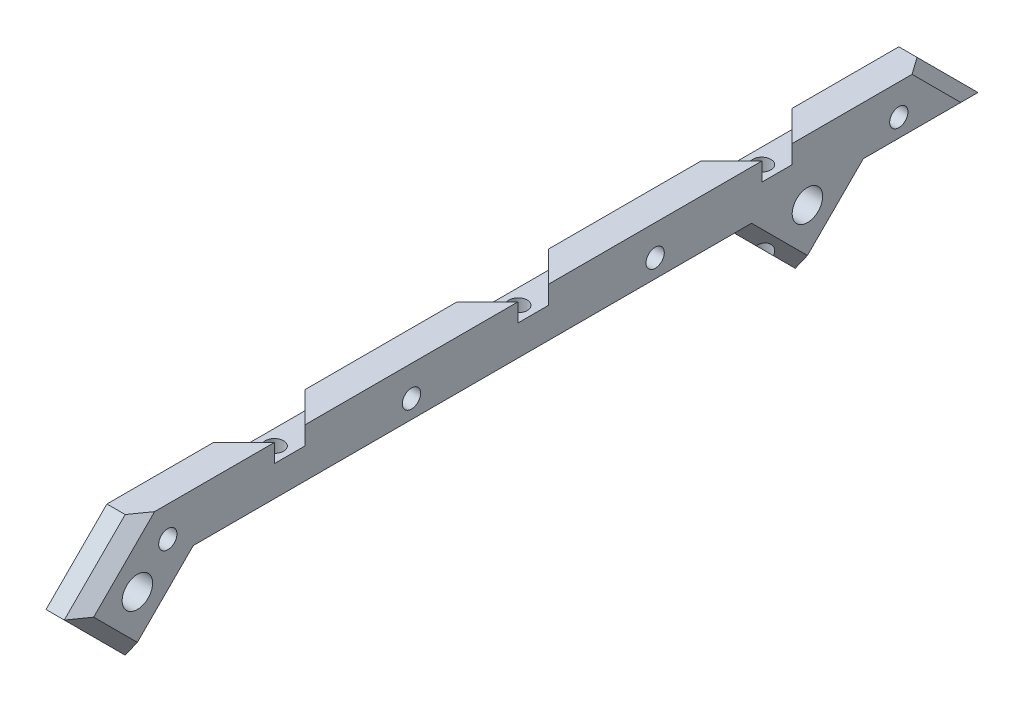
from build123d import *

# Parameters (mm, degrees)
CROQUIS1_R              = 2.5
SALIENTE_EXTRUIR1_DEPTH = 5
CHAFL_N1_SIZE           = 2
CROQUIS2_R              = 1.5
CORTAR_EXTRUIR1_DEPTH   = 76.828754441
CORTAR_EXTRUIR2_DEPTH   = 3
CROQUIS4_R              = 1.5
CORTAR_EXTRUIR3_DEPTH   = 78.064907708


with BuildPart() as part:
    # Croquis1 → Saliente-Extruir1 (new body)
    with BuildSketch(Plane(origin=(0, 0, 0), x_dir=(0, 0, -1), z_dir=(1, 0, 0))):
        Polygon((-75, 0), (-65, -10), (-55, 0), (35, 0), (45, -10), (55, 0), (75, 0), (65, 10), (-65, 10), align=None)
        with Locations((45, 0)):
            Circle(CROQUIS1_R, mode=Mode.SUBTRACT)
        with Locations((-65, 0)):
            Circle(CROQUIS1_R, mode=Mode.SUBTRACT)
    extrude(amount=SALIENTE_EXTRUIR1_DEPTH)

    # Chafl_n1
    chafl_n1_edges = [part.edges().sort_by_distance(p)[0] for p in [
        (5, -5, 70),
        (5, -5, 60),
        (5, 0, 10),
        (5, -5, -40),
        (5, -5, -50),
        (5, 0, -65),
        (5, 5, -70),
        (5, 5, 70),
    ]]
    chamfer(chafl_n1_edges, length=CHAFL_N1_SIZE)

    # Croquis2 → Cortar-Extruir1 (cut, through all)
    with BuildSketch(Plane(origin=(5, 0, 0), x_dir=(0, 0, -1), z_dir=(1, 0, 0))):
        with Locations((-60, 5)):
            Circle(CROQUIS2_R)
        with Locations((-20, 5)):
            Circle(CROQUIS2_R)
        with Locations((20, 5)):
            Circle(CROQUIS2_R)
        with Locations((60, 5)):
            Circle(CROQUIS2_R)
    extrude(amount=-CORTAR_EXTRUIR1_DEPTH, mode=Mode.SUBTRACT)

    # Croquis3 → Cortar-Extruir2 (cut)
    with BuildSketch(Plane(origin=(0, 10, 0), x_dir=(1, 0, 0), z_dir=(0, 1, 0))):
        Polygon((0, 7.5), (0, -7.5), (5, -2.5), (5, 2.5), align=None)
        Polygon((5, -37.5), (0, -32.5), (0, -47.5), (5, -42.5), align=None)
        Polygon((0, 32.5), (5, 37.5), (5, 42.5), (0, 47.5), align=None)
    extrude(amount=-CORTAR_EXTRUIR2_DEPTH, mode=Mode.SUBTRACT)

    # Croquis4 → Cortar-Extruir3 (cut, through all)
    with BuildSketch(Plane(origin=(0, 7, 0), x_dir=(1, 0, 0), z_dir=(0, 1, 0))):
        with Locations(Location((2.5, -40, 0), (0, 0, 270))):
            Circle(CROQUIS4_R)
        with Locations(Location((2.5, 0, 0), (0, 0, 270))):
            Circle(CROQUIS4_R)
        with Locations(Location((2.5, 40, 0), (0, 0, 270))):
            Circle(CROQUIS4_R)
    extrude(amount=-CORTAR_EXTRUIR3_DEPTH, mode=Mode.SUBTRACT)


solid = part.part
